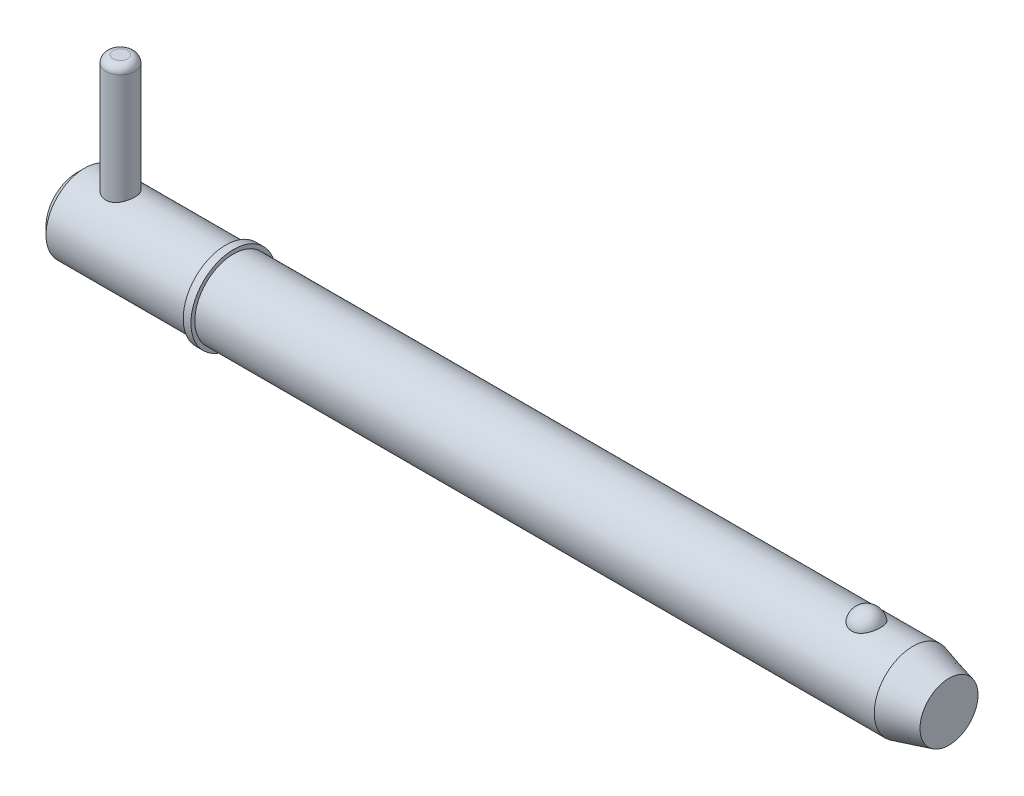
ISO-10303-21;
HEADER;
FILE_DESCRIPTION(('STEP AP214'),'2;1');
FILE_NAME('part.step','',(''),(''),'','','');
FILE_SCHEMA(('AUTOMOTIVE_DESIGN { 1 0 10303 214 1 1 1 1 }'));
ENDSEC;
DATA;
#1=APPLICATION_CONTEXT('core data for automotive mechanical design processes');
#2=APPLICATION_PROTOCOL_DEFINITION('international standard','automotive_design',2000,#1);
#3=PRODUCT_CONTEXT('',#1,'mechanical');
#4=PRODUCT('Part','Part','',(#3));
#5=PRODUCT_RELATED_PRODUCT_CATEGORY('part','',(#4));
#6=PRODUCT_DEFINITION_FORMATION('','',#4);
#7=PRODUCT_DEFINITION_CONTEXT('part definition',#1,'design');
#8=PRODUCT_DEFINITION('design','',#6,#7);
#9=PRODUCT_DEFINITION_SHAPE('','',#8);
#10=(LENGTH_UNIT() NAMED_UNIT(*) SI_UNIT(.MILLI.,.METRE.));
#11=(NAMED_UNIT(*) PLANE_ANGLE_UNIT() SI_UNIT($,.RADIAN.));
#12=(NAMED_UNIT(*) SI_UNIT($,.STERADIAN.) SOLID_ANGLE_UNIT());
#13=UNCERTAINTY_MEASURE_WITH_UNIT(LENGTH_MEASURE(1.E-05),#10,'distance_accuracy_value','');
#14=(GEOMETRIC_REPRESENTATION_CONTEXT(3) GLOBAL_UNCERTAINTY_ASSIGNED_CONTEXT((#13)) GLOBAL_UNIT_ASSIGNED_CONTEXT((#10,
#11,#12)) REPRESENTATION_CONTEXT('',''));
#15=CARTESIAN_POINT('',(0.,0.,0.));
#16=DIRECTION('',(0.,0.,1.));
#17=DIRECTION('',(1.,0.,0.));
#18=AXIS2_PLACEMENT_3D('',#15,#16,#17);
#19=CARTESIAN_POINT('',(7.14,25.4,0.));
#20=DIRECTION('',(0.,-1.,0.));
#21=DIRECTION('',(0.,0.,-1.));
#22=AXIS2_PLACEMENT_3D('',#19,#20,#21);
#23=CYLINDRICAL_SURFACE('',#22,2.38);
#24=CARTESIAN_POINT('',(7.14,-5.16,0.));
#25=DIRECTION('',(0.,1.,0.));
#26=DIRECTION('',(0.,0.,1.));
#27=AXIS2_PLACEMENT_3D('',#24,#25,#26);
#28=CIRCLE('',#27,2.38);
#29=CARTESIAN_POINT('',(7.14,-5.16,2.38));
#30=VERTEX_POINT('',#29);
#31=EDGE_CURVE('P0_E25',#30,#30,#28,.T.);
#32=ORIENTED_EDGE('',*,*,#31,.T.);
#33=EDGE_LOOP('',(#32));
#34=FACE_BOUND('',#33,.T.);
#35=CARTESIAN_POINT('',(7.14,24.21,0.));
#36=DIRECTION('',(0.,1.,0.));
#37=DIRECTION('',(0.,0.,1.));
#38=AXIS2_PLACEMENT_3D('',#35,#36,#37);
#39=CIRCLE('',#38,2.38);
#40=CARTESIAN_POINT('',(7.14,24.21,2.38));
#41=VERTEX_POINT('',#40);
#42=EDGE_CURVE('P0_E29',#41,#41,#39,.F.);
#43=ORIENTED_EDGE('',*,*,#42,.T.);
#44=EDGE_LOOP('',(#43));
#45=FACE_BOUND('',#44,.T.);
#46=ADVANCED_FACE('P0_F14',(#34,#45),#23,.T.);
#47=CARTESIAN_POINT('',(7.14,25.4,0.));
#48=DIRECTION('',(0.,1.,0.));
#49=DIRECTION('',(0.,0.,1.));
#50=AXIS2_PLACEMENT_3D('',#47,#48,#49);
#51=PLANE('',#50);
#52=CARTESIAN_POINT('',(7.14,25.4,0.));
#53=DIRECTION('',(0.,1.,0.));
#54=DIRECTION('',(0.,0.,1.));
#55=AXIS2_PLACEMENT_3D('',#52,#53,#54);
#56=CIRCLE('',#55,1.19);
#57=CARTESIAN_POINT('',(7.14,25.4,1.19));
#58=VERTEX_POINT('',#57);
#59=EDGE_CURVE('P0_E10',#58,#58,#56,.T.);
#60=ORIENTED_EDGE('',*,*,#59,.T.);
#61=EDGE_LOOP('',(#60));
#62=FACE_BOUND('',#61,.T.);
#63=ADVANCED_FACE('P0_F46',(#62),#51,.T.);
#64=CARTESIAN_POINT('',(7.14,-6.35,0.));
#65=DIRECTION('',(0.,1.,0.));
#66=DIRECTION('',(0.,0.,1.));
#67=AXIS2_PLACEMENT_3D('',#64,#65,#66);
#68=PLANE('',#67);
#69=CARTESIAN_POINT('',(7.14,-6.35,0.));
#70=DIRECTION('',(0.,1.,0.));
#71=DIRECTION('',(0.,0.,1.));
#72=AXIS2_PLACEMENT_3D('',#69,#70,#71);
#73=CIRCLE('',#72,1.19);
#74=CARTESIAN_POINT('',(7.14,-6.35,1.19));
#75=VERTEX_POINT('',#74);
#76=EDGE_CURVE('P0_E21',#75,#75,#73,.F.);
#77=ORIENTED_EDGE('',*,*,#76,.T.);
#78=EDGE_LOOP('',(#77));
#79=FACE_BOUND('',#78,.T.);
#80=ADVANCED_FACE('P0_F43',(#79),#68,.F.);
#81=CARTESIAN_POINT('',(7.14,-5.16,0.));
#82=DIRECTION('',(0.,1.,0.));
#83=DIRECTION('',(0.,0.,1.));
#84=AXIS2_PLACEMENT_3D('',#81,#82,#83);
#85=DEGENERATE_TOROIDAL_SURFACE('',#84,1.19,1.19,.T.);
#86=ORIENTED_EDGE('',*,*,#76,.F.);
#87=EDGE_LOOP('',(#86));
#88=FACE_BOUND('',#87,.T.);
#89=ORIENTED_EDGE('',*,*,#31,.F.);
#90=EDGE_LOOP('',(#89));
#91=FACE_BOUND('',#90,.T.);
#92=ADVANCED_FACE('P0_F38',(#88,#91),#85,.T.);
#93=CARTESIAN_POINT('',(7.14,24.21,0.));
#94=DIRECTION('',(0.,1.,0.));
#95=DIRECTION('',(0.,0.,1.));
#96=AXIS2_PLACEMENT_3D('',#93,#94,#95);
#97=DEGENERATE_TOROIDAL_SURFACE('',#96,1.19,1.19,.T.);
#98=ORIENTED_EDGE('',*,*,#42,.F.);
#99=EDGE_LOOP('',(#98));
#100=FACE_BOUND('',#99,.T.);
#101=ORIENTED_EDGE('',*,*,#59,.F.);
#102=EDGE_LOOP('',(#101));
#103=FACE_BOUND('',#102,.T.);
#104=ADVANCED_FACE('P0_F16',(#100,#103),#97,.T.);
#105=CLOSED_SHELL('',(#46,#63,#80,#92,#104));
#106=MANIFOLD_SOLID_BREP('P0_B1',#105);
#107=CARTESIAN_POINT('',(0.,0.,0.));
#108=DIRECTION('',(1.,0.,0.));
#109=DIRECTION('',(0.,0.,-1.));
#110=AXIS2_PLACEMENT_3D('',#107,#108,#109);
#111=CYLINDRICAL_SURFACE('',#110,6.35);
#112=CARTESIAN_POINT('',(137.255369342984,0.,0.));
#113=DIRECTION('',(1.,0.,0.));
#114=DIRECTION('',(0.,0.,-1.));
#115=AXIS2_PLACEMENT_3D('',#112,#113,#114);
#116=CIRCLE('',#115,6.35);
#117=CARTESIAN_POINT('',(137.255369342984,0.,-6.35));
#118=VERTEX_POINT('',#117);
#119=EDGE_CURVE('P1_E81',#118,#118,#116,.T.);
#120=ORIENTED_EDGE('',*,*,#119,.F.);
#121=EDGE_LOOP('',(#120));
#122=FACE_BOUND('',#121,.T.);
#123=CARTESIAN_POINT('',(25.7,0.,0.));
#124=DIRECTION('',(1.,0.,0.));
#125=DIRECTION('',(0.,0.,-1.));
#126=AXIS2_PLACEMENT_3D('',#123,#124,#125);
#127=CIRCLE('',#126,6.35);
#128=CARTESIAN_POINT('',(25.7,0.,-6.35));
#129=VERTEX_POINT('',#128);
#130=EDGE_CURVE('P1_E85',#129,#129,#127,.T.);
#131=ORIENTED_EDGE('',*,*,#130,.T.);
#132=EDGE_LOOP('',(#131));
#133=FACE_BOUND('',#132,.T.);
#134=CARTESIAN_POINT('',(129.630021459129,5.87502187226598,2.40969251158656));
#135=CARTESIAN_POINT('',(129.505030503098,5.87501645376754,2.40969773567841));
#136=CARTESIAN_POINT('',(129.380080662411,5.87916061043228,2.3996729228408));
#137=CARTESIAN_POINT('',(129.133909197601,5.89523112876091,2.35991730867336));
#138=CARTESIAN_POINT('',(129.012686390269,5.90715499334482,2.33019283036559));
#139=CARTESIAN_POINT('',(128.777517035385,5.9373956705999,2.25201402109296));
#140=CARTESIAN_POINT('',(128.663560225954,5.95570321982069,2.20358681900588));
#141=CARTESIAN_POINT('',(128.44557352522,5.99672067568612,2.08937987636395));
#142=CARTESIAN_POINT('',(128.341545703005,6.01943149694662,2.0235965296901));
#143=CARTESIAN_POINT('',(128.142943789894,6.06760647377,1.87428969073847));
#144=CARTESIAN_POINT('',(128.048726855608,6.0931309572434,1.79031110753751));
#145=CARTESIAN_POINT('',(127.875255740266,6.14375873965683,1.60800178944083));
#146=CARTESIAN_POINT('',(127.796004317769,6.16886196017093,1.50966841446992));
#147=CARTESIAN_POINT('',(127.650845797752,6.2172460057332,1.29645884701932));
#148=CARTESIAN_POINT('',(127.585688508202,6.24039621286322,1.18104158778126));
#149=CARTESIAN_POINT('',(127.474703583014,6.28117277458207,0.940351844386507));
#150=CARTESIAN_POINT('',(127.428877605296,6.29879865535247,0.815078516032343));
#151=CARTESIAN_POINT('',(127.357023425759,6.32692073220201,0.556494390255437));
#152=CARTESIAN_POINT('',(127.331249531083,6.33732517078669,0.423102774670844));
#153=CARTESIAN_POINT('',(127.300988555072,6.34957673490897,0.15354272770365));
#154=CARTESIAN_POINT('',(127.296500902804,6.35142408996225,0.0173743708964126));
#155=CARTESIAN_POINT('',(127.308865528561,6.34638925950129,-0.253036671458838));
#156=CARTESIAN_POINT('',(127.325594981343,6.33955731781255,-0.38728593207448));
#157=CARTESIAN_POINT('',(127.379843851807,6.31794129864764,-0.650851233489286));
#158=CARTESIAN_POINT('',(127.417363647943,6.30315707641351,-0.780167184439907));
#159=CARTESIAN_POINT('',(127.512500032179,6.26711642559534,-1.03041949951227));
#160=CARTESIAN_POINT('',(127.570143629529,6.24585130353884,-1.1513443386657));
#161=CARTESIAN_POINT('',(127.704352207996,6.19905619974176,-1.38129800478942));
#162=CARTESIAN_POINT('',(127.780918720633,6.17352587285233,-1.49032586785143));
#163=CARTESIAN_POINT('',(127.951753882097,6.12080227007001,-1.69393164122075));
#164=CARTESIAN_POINT('',(128.046100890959,6.09360200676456,-1.78844209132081));
#165=CARTESIAN_POINT('',(128.250119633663,6.0407043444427,-1.95970536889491));
#166=CARTESIAN_POINT('',(128.359790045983,6.01500681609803,-2.03645972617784));
#167=CARTESIAN_POINT('',(128.589187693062,5.96867714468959,-2.16845644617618));
#168=CARTESIAN_POINT('',(128.708652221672,5.94794910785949,-2.22412062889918));
#169=CARTESIAN_POINT('',(128.956218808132,5.91340580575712,-2.31440992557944));
#170=CARTESIAN_POINT('',(129.084317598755,5.8995879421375,-2.34904294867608));
#171=CARTESIAN_POINT('',(129.338582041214,5.88111049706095,-2.39491590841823));
#172=CARTESIAN_POINT('',(129.464520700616,5.876025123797,-2.40724512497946));
#173=CARTESIAN_POINT('',(129.716786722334,5.87428980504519,-2.41147867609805));
#174=CARTESIAN_POINT('',(129.843114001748,5.87763817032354,-2.4033871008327));
#175=CARTESIAN_POINT('',(130.088417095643,5.89212921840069,-2.36762715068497));
#176=CARTESIAN_POINT('',(130.207499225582,5.90302431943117,-2.34058030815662));
#177=CARTESIAN_POINT('',(130.43924472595,5.93113752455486,-2.26839066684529));
#178=CARTESIAN_POINT('',(130.551907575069,5.94835614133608,-2.22324640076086));
#179=CARTESIAN_POINT('',(130.770400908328,5.98773016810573,-2.1149380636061));
#180=CARTESIAN_POINT('',(130.876028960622,6.00998499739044,-2.05140269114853));
#181=CARTESIAN_POINT('',(131.075300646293,6.0569014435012,-1.9084270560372));
#182=CARTESIAN_POINT('',(131.168941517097,6.08156361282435,-1.82898313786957));
#183=CARTESIAN_POINT('',(131.346675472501,6.13211715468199,-1.65182429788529));
#184=CARTESIAN_POINT('',(131.430055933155,6.15800825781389,-1.55339381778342));
#185=CARTESIAN_POINT('',(131.579790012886,6.2071283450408,-1.34374214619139));
#186=CARTESIAN_POINT('',(131.646140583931,6.23035685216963,-1.23251867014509));
#187=CARTESIAN_POINT('',(131.762345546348,6.27251177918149,-0.99644720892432));
#188=CARTESIAN_POINT('',(131.811607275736,6.29127762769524,-0.871278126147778));
#189=CARTESIAN_POINT('',(131.889614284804,6.3215862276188,-0.613870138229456));
#190=CARTESIAN_POINT('',(131.918359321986,6.33312889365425,-0.481631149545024));
#191=CARTESIAN_POINT('',(131.95477058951,6.34782349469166,-0.213672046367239));
#192=CARTESIAN_POINT('',(131.962413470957,6.35096613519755,-0.0779482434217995));
#193=CARTESIAN_POINT('',(131.956395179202,6.34851322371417,0.192943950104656));
#194=CARTESIAN_POINT('',(131.942734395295,6.3429178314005,0.328112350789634));
#195=CARTESIAN_POINT('',(131.89450361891,6.32360512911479,0.593406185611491));
#196=CARTESIAN_POINT('',(131.860031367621,6.30992579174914,0.723552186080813));
#197=CARTESIAN_POINT('',(131.770953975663,6.27586325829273,0.975834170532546));
#198=CARTESIAN_POINT('',(131.71634761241,6.25547965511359,1.09796966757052));
#199=CARTESIAN_POINT('',(131.58775879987,6.20998183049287,1.33148921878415));
#200=CARTESIAN_POINT('',(131.513674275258,6.18484288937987,1.44281227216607));
#201=CARTESIAN_POINT('',(131.347820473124,6.13258735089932,1.65087683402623));
#202=CARTESIAN_POINT('',(131.256051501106,6.10547078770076,1.74761859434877));
#203=CARTESIAN_POINT('',(131.057183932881,6.05235879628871,1.92350926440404));
#204=CARTESIAN_POINT('',(130.950133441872,6.02636017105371,2.00271146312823));
#205=CARTESIAN_POINT('',(130.723138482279,5.97843747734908,2.14154159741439));
#206=CARTESIAN_POINT('',(130.603191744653,5.95651412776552,2.2011660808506));
#207=CARTESIAN_POINT('',(130.344523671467,5.91812106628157,2.30250570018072));
#208=CARTESIAN_POINT('',(130.20506980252,5.90217533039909,2.34256795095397));
#209=CARTESIAN_POINT('',(129.920397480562,5.88063128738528,2.39615214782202));
#210=CARTESIAN_POINT('',(129.77518174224,5.87502816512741,2.40968644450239));
#211=CARTESIAN_POINT('',(129.630021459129,5.87502187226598,2.40969251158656));
#212=B_SPLINE_CURVE_WITH_KNOTS('',3,(#134,#135,#136,#137,#138,#139,#140,#141,#142,#143,#144,
#145,#146,#147,#148,#149,#150,#151,#152,#153,#154,#155,#156,#157,#158,#159,#160,#161,#162,#163,
#164,#165,#166,#167,#168,#169,#170,#171,#172,#173,#174,#175,#176,#177,#178,#179,#180,#181,#182,
#183,#184,#185,#186,#187,#188,#189,#190,#191,#192,#193,#194,#195,#196,#197,#198,#199,#200,#201,
#202,#203,#204,#205,#206,#207,#208,#209,#210,#211),.UNSPECIFIED.,.T.,.F.,(4,2,2,2,2,2,2,2,2,2,2,
2,2,2,2,2,2,2,2,2,2,2,2,2,2,2,2,2,2,2,2,2,2,2,2,2,2,2,4),(0.,0.374440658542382,
0.748761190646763,1.12254078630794,1.49639810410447,1.88098871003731,2.2656501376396,
2.66741104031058,3.06920639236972,3.47601794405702,3.88281858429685,4.28727498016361,
4.69173873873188,5.09674745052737,5.50178895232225,5.90865911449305,6.31549420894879,
6.71369855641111,7.11175305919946,7.48978077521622,7.8677327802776,8.23383886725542,
8.5999746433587,8.97409044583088,9.34829231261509,9.74122667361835,10.1342313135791,
10.539752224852,10.945277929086,11.3512521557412,11.7572189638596,12.1612938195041,
12.5653932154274,12.9716540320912,13.37790783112,13.782909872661,14.1879832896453,
14.6230486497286,15.0579114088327),.UNSPECIFIED.);
#213=CARTESIAN_POINT('',(129.630021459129,5.87502187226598,2.40969251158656));
#214=VERTEX_POINT('',#213);
#215=EDGE_CURVE('P1_E35',#214,#214,#212,.T.);
#216=ORIENTED_EDGE('',*,*,#215,.T.);
#217=EDGE_LOOP('',(#216));
#218=FACE_BOUND('',#217,.T.);
#219=ADVANCED_FACE('P1_F13',(#122,#133,#218),#111,.T.);
#220=CARTESIAN_POINT('',(0.,0.,0.));
#221=DIRECTION('',(-1.,0.,0.));
#222=DIRECTION('',(0.,0.,1.));
#223=AXIS2_PLACEMENT_3D('',#220,#221,#222);
#224=PLANE('',#223);
#225=CARTESIAN_POINT('',(0.,0.,0.));
#226=DIRECTION('',(1.,0.,0.));
#227=DIRECTION('',(0.,0.,-1.));
#228=AXIS2_PLACEMENT_3D('',#225,#226,#227);
#229=CIRCLE('',#228,5.08);
#230=CARTESIAN_POINT('',(0.,0.,-5.08));
#231=VERTEX_POINT('',#230);
#232=EDGE_CURVE('P1_E9',#231,#231,#229,.T.);
#233=ORIENTED_EDGE('',*,*,#232,.F.);
#234=EDGE_LOOP('',(#233));
#235=FACE_BOUND('',#234,.T.);
#236=ADVANCED_FACE('P1_F15',(#235),#224,.T.);
#237=CARTESIAN_POINT('',(1.27,0.,0.));
#238=DIRECTION('',(1.,0.,0.));
#239=DIRECTION('',(0.,0.,-1.));
#240=AXIS2_PLACEMENT_3D('',#237,#238,#239);
#241=CONICAL_SURFACE('',#240,6.35,0.78539816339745);
#242=ORIENTED_EDGE('',*,*,#232,.T.);
#243=EDGE_LOOP('',(#242));
#244=FACE_BOUND('',#243,.T.);
#245=CARTESIAN_POINT('',(1.27,0.,0.));
#246=DIRECTION('',(1.,0.,0.));
#247=DIRECTION('',(0.,0.,-1.));
#248=AXIS2_PLACEMENT_3D('',#245,#246,#247);
#249=CIRCLE('',#248,6.35);
#250=CARTESIAN_POINT('',(1.27,0.,-6.35));
#251=VERTEX_POINT('',#250);
#252=EDGE_CURVE('P1_E26',#251,#251,#249,.T.);
#253=ORIENTED_EDGE('',*,*,#252,.F.);
#254=EDGE_LOOP('',(#253));
#255=FACE_BOUND('',#254,.T.);
#256=ADVANCED_FACE('P1_F77',(#244,#255),#241,.T.);
#257=CARTESIAN_POINT('',(0.,0.,0.));
#258=DIRECTION('',(1.,0.,0.));
#259=DIRECTION('',(0.,0.,-1.));
#260=AXIS2_PLACEMENT_3D('',#257,#258,#259);
#261=CYLINDRICAL_SURFACE('',#260,6.35);
#262=CARTESIAN_POINT('',(7.14,-5.88711304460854,2.38));
#263=CARTESIAN_POINT('',(7.01146258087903,-5.88710856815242,2.38000480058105));
#264=CARTESIAN_POINT('',(6.88295682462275,-5.89136840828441,2.36955244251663));
#265=CARTESIAN_POINT('',(6.62981934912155,-5.90782785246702,2.32820953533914));
#266=CARTESIAN_POINT('',(6.50518751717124,-5.92002722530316,2.29731958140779));
#267=CARTESIAN_POINT('',(6.26352403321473,-5.95079384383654,2.21639366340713));
#268=CARTESIAN_POINT('',(6.14647496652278,-5.96934583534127,2.16640353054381));
#269=CARTESIAN_POINT('',(5.92237941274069,-6.01070278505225,2.04885862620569));
#270=CARTESIAN_POINT('',(5.81533593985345,-6.03350901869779,1.98129858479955));
#271=CARTESIAN_POINT('',(5.60897525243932,-6.08207341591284,1.82693902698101));
#272=CARTESIAN_POINT('',(5.51022503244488,-6.10791836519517,1.73940861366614));
#273=CARTESIAN_POINT('',(5.32840561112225,-6.15892405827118,1.54914379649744));
#274=CARTESIAN_POINT('',(5.24533975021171,-6.1840846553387,1.44640616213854));
#275=CARTESIAN_POINT('',(5.09451639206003,-6.23191821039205,1.22434014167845));
#276=CARTESIAN_POINT('',(5.02737511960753,-6.25447755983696,1.10456656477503));
#277=CARTESIAN_POINT('',(4.91443001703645,-6.2935236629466,0.854429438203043));
#278=CARTESIAN_POINT('',(4.86861879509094,-6.31001251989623,0.724069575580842));
#279=CARTESIAN_POINT('',(4.80162253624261,-6.33444370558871,0.46242122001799));
#280=CARTESIAN_POINT('',(4.77946137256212,-6.34272370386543,0.331414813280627));
#281=CARTESIAN_POINT('',(4.75726677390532,-6.35101600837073,0.0672982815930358));
#282=CARTESIAN_POINT('',(4.75722615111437,-6.35103100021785,-0.0658111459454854));
#283=CARTESIAN_POINT('',(4.77870510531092,-6.3430064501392,-0.323358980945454));
#284=CARTESIAN_POINT('',(4.79915922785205,-6.33536494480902,-0.447900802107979));
#285=CARTESIAN_POINT('',(4.85925493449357,-6.31340794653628,-0.69163609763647));
#286=CARTESIAN_POINT('',(4.89889787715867,-6.29909198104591,-0.810829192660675));
#287=CARTESIAN_POINT('',(4.9967414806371,-6.26494471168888,-1.04254212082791));
#288=CARTESIAN_POINT('',(5.05520370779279,-6.24503620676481,-1.1549396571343));
#289=CARTESIAN_POINT('',(5.1887948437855,-6.20171869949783,-1.3686079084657));
#290=CARTESIAN_POINT('',(5.26392912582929,-6.17830856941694,-1.46987502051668));
#291=CARTESIAN_POINT('',(5.43386591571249,-6.12878580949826,-1.66468415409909));
#292=CARTESIAN_POINT('',(5.52956139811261,-6.10259519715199,-1.75742857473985));
#293=CARTESIAN_POINT('',(5.73530435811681,-6.05155777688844,-1.92585331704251));
#294=CARTESIAN_POINT('',(5.84535542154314,-6.02671130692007,-2.00152936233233));
#295=CARTESIAN_POINT('',(6.07982989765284,-5.98068420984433,-2.13519109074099));
#296=CARTESIAN_POINT('',(6.20451768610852,-5.95959698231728,-2.19274775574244));
#297=CARTESIAN_POINT('',(6.4628145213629,-5.92455622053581,-2.28574558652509));
#298=CARTESIAN_POINT('',(6.59641856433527,-5.91059872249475,-2.32119904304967));
#299=CARTESIAN_POINT('',(6.86087441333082,-5.8923327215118,-2.36717069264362));
#300=CARTESIAN_POINT('',(6.99147192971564,-5.8875347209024,-2.37895573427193));
#301=CARTESIAN_POINT('',(7.25283805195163,-5.88674545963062,-2.38091046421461));
#302=CARTESIAN_POINT('',(7.38360660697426,-5.89075200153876,-2.37108554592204));
#303=CARTESIAN_POINT('',(7.63510696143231,-5.90662331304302,-2.33124781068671));
#304=CARTESIAN_POINT('',(7.75602069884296,-5.91810660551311,-2.30221396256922));
#305=CARTESIAN_POINT('',(7.99120505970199,-5.94718527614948,-2.22601401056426));
#306=CARTESIAN_POINT('',(8.10547431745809,-5.96478190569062,-2.17884419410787));
#307=CARTESIAN_POINT('',(8.32888632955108,-6.00491533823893,-2.06572311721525));
#308=CARTESIAN_POINT('',(8.43767672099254,-6.02761250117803,-1.99913452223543));
#309=CARTESIAN_POINT('',(8.6429894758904,-6.07511988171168,-1.84974438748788));
#310=CARTESIAN_POINT('',(8.73950733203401,-6.09993087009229,-1.76693691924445));
#311=CARTESIAN_POINT('',(8.9238741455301,-6.1507686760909,-1.58125563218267));
#312=CARTESIAN_POINT('',(9.01078732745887,-6.17677301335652,-1.47744327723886));
#313=CARTESIAN_POINT('',(9.16607127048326,-6.22556172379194,-1.25606967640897));
#314=CARTESIAN_POINT('',(9.23444197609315,-6.24834608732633,-1.13850838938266));
#315=CARTESIAN_POINT('',(9.3502493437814,-6.28811144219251,-0.893050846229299));
#316=CARTESIAN_POINT('',(9.39775808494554,-6.30511236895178,-0.765192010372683));
#317=CARTESIAN_POINT('',(9.47032640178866,-6.33145833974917,-0.502514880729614));
#318=CARTESIAN_POINT('',(9.49539651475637,-6.34080697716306,-0.367699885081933));
#319=CARTESIAN_POINT('',(9.52124059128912,-6.35045496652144,-0.103396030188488));
#320=CARTESIAN_POINT('',(9.52334421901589,-6.35124952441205,0.025945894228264));
#321=CARTESIAN_POINT('',(9.50661518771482,-6.34499064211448,0.283061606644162));
#322=CARTESIAN_POINT('',(9.48778504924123,-6.33793814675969,0.410835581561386));
#323=CARTESIAN_POINT('',(9.43065630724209,-6.31700307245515,0.658028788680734));
#324=CARTESIAN_POINT('',(9.39284291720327,-6.30329098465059,0.7775756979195));
#325=CARTESIAN_POINT('',(9.29930406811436,-6.27046903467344,1.00863789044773));
#326=CARTESIAN_POINT('',(9.2435752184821,-6.25135815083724,1.12015164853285));
#327=CARTESIAN_POINT('',(9.11312349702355,-6.20865254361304,1.33711407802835));
#328=CARTESIAN_POINT('',(9.03770094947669,-6.18490316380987,1.44211105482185));
#329=CARTESIAN_POINT('',(8.87110640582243,-6.13583718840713,1.63836897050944));
#330=CARTESIAN_POINT('',(8.77992879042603,-6.11052003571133,1.72962498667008));
#331=CARTESIAN_POINT('',(8.57869799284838,-6.05953829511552,1.90076098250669));
#332=CARTESIAN_POINT('',(8.46790320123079,-6.03392573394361,1.97978778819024));
#333=CARTESIAN_POINT('',(8.23379693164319,-5.98676607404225,2.11813466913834));
#334=CARTESIAN_POINT('',(8.11048418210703,-5.9652193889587,2.17745273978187));
#335=CARTESIAN_POINT('',(7.84900037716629,-5.92818393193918,2.27641807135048));
#336=CARTESIAN_POINT('',(7.71041678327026,-5.91299857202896,2.31510015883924));
#337=CARTESIAN_POINT('',(7.42787316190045,-5.89246887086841,2.36688002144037));
#338=CARTESIAN_POINT('',(7.28391673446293,-5.88711805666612,2.37999462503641));
#339=CARTESIAN_POINT('',(7.14,-5.88711304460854,2.38));
#340=B_SPLINE_CURVE_WITH_KNOTS('',3,(#262,#263,#264,#265,#266,#267,#268,#269,#270,#271,#272,
#273,#274,#275,#276,#277,#278,#279,#280,#281,#282,#283,#284,#285,#286,#287,#288,#289,#290,#291,
#292,#293,#294,#295,#296,#297,#298,#299,#300,#301,#302,#303,#304,#305,#306,#307,#308,#309,#310,
#311,#312,#313,#314,#315,#316,#317,#318,#319,#320,#321,#322,#323,#324,#325,#326,#327,#328,#329,
#330,#331,#332,#333,#334,#335,#336,#337,#338,#339),.UNSPECIFIED.,.T.,.F.,(4,2,2,2,2,2,2,2,2,2,2,
2,2,2,2,2,2,2,2,2,2,2,2,2,2,2,2,2,2,2,2,2,2,2,2,2,2,2,4),(0.,0.385076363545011,
0.770141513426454,1.15428843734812,1.53855071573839,1.94016118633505,2.3418570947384,
2.75720522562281,3.1724093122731,3.569721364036,3.96690431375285,4.34445758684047,
4.72203759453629,5.10511017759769,5.48830640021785,5.89390240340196,6.29959991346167,
6.71428455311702,7.12873839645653,7.52034494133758,7.91185376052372,8.28480528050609,
8.65783318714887,9.0448340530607,9.43197664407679,9.84363087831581,10.2552863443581,
10.6655081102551,11.0755371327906,11.4616919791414,11.847800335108,12.224507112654,
12.6012852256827,12.9938941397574,13.386643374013,13.8000944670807,14.2135876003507,
14.6450218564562,15.0761720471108),.UNSPECIFIED.);
#341=CARTESIAN_POINT('',(7.14,-5.88711304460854,2.38));
#342=VERTEX_POINT('',#341);
#343=EDGE_CURVE('P1_E17',#342,#342,#340,.T.);
#344=ORIENTED_EDGE('',*,*,#343,.F.);
#345=EDGE_LOOP('',(#344));
#346=FACE_BOUND('',#345,.T.);
#347=CARTESIAN_POINT('',(7.14,5.88711304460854,2.38));
#348=CARTESIAN_POINT('',(7.26853741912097,5.88710856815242,2.38000480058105));
#349=CARTESIAN_POINT('',(7.39704317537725,5.89136840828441,2.36955244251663));
#350=CARTESIAN_POINT('',(7.65018065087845,5.90782785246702,2.32820953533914));
#351=CARTESIAN_POINT('',(7.77481248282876,5.92002722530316,2.29731958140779));
#352=CARTESIAN_POINT('',(8.01647596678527,5.95079384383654,2.21639366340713));
#353=CARTESIAN_POINT('',(8.13352503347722,5.96934583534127,2.16640353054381));
#354=CARTESIAN_POINT('',(8.35762058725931,6.01070278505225,2.04885862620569));
#355=CARTESIAN_POINT('',(8.46466406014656,6.03350901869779,1.98129858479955));
#356=CARTESIAN_POINT('',(8.67102474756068,6.08207341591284,1.82693902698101));
#357=CARTESIAN_POINT('',(8.76977496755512,6.10791836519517,1.73940861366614));
#358=CARTESIAN_POINT('',(8.95159438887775,6.15892405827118,1.54914379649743));
#359=CARTESIAN_POINT('',(9.03466024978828,6.1840846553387,1.44640616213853));
#360=CARTESIAN_POINT('',(9.18548360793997,6.23191821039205,1.22434014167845));
#361=CARTESIAN_POINT('',(9.25262488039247,6.25447755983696,1.10456656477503));
#362=CARTESIAN_POINT('',(9.36556998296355,6.2935236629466,0.854429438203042));
#363=CARTESIAN_POINT('',(9.41138120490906,6.31001251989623,0.72406957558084));
#364=CARTESIAN_POINT('',(9.47837746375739,6.33444370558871,0.462421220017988));
#365=CARTESIAN_POINT('',(9.50053862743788,6.34272370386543,0.331414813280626));
#366=CARTESIAN_POINT('',(9.52273322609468,6.35101600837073,0.0672982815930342));
#367=CARTESIAN_POINT('',(9.52277384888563,6.35103100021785,-0.0658111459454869));
#368=CARTESIAN_POINT('',(9.50129489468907,6.3430064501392,-0.323358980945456));
#369=CARTESIAN_POINT('',(9.48084077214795,6.33536494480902,-0.447900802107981));
#370=CARTESIAN_POINT('',(9.42074506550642,6.31340794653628,-0.691636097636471));
#371=CARTESIAN_POINT('',(9.38110212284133,6.29909198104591,-0.810829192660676));
#372=CARTESIAN_POINT('',(9.2832585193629,6.26494471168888,-1.04254212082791));
#373=CARTESIAN_POINT('',(9.22479629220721,6.24503620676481,-1.1549396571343));
#374=CARTESIAN_POINT('',(9.0912051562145,6.20171869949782,-1.3686079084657));
#375=CARTESIAN_POINT('',(9.0160708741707,6.17830856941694,-1.46987502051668));
#376=CARTESIAN_POINT('',(8.84613408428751,6.12878580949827,-1.66468415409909));
#377=CARTESIAN_POINT('',(8.75043860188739,6.10259519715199,-1.75742857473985));
#378=CARTESIAN_POINT('',(8.54469564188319,6.05155777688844,-1.92585331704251));
#379=CARTESIAN_POINT('',(8.43464457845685,6.02671130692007,-2.00152936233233));
#380=CARTESIAN_POINT('',(8.20017010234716,5.98068420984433,-2.13519109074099));
#381=CARTESIAN_POINT('',(8.07548231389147,5.95959698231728,-2.19274775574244));
#382=CARTESIAN_POINT('',(7.8171854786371,5.9245562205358,-2.28574558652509));
#383=CARTESIAN_POINT('',(7.68358143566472,5.91059872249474,-2.32119904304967));
#384=CARTESIAN_POINT('',(7.41912558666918,5.8923327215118,-2.36717069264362));
#385=CARTESIAN_POINT('',(7.28852807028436,5.8875347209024,-2.37895573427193));
#386=CARTESIAN_POINT('',(7.02716194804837,5.88674545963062,-2.38091046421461));
#387=CARTESIAN_POINT('',(6.89639339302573,5.89075200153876,-2.37108554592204));
#388=CARTESIAN_POINT('',(6.64489303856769,5.90662331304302,-2.33124781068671));
#389=CARTESIAN_POINT('',(6.52397930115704,5.91810660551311,-2.30221396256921));
#390=CARTESIAN_POINT('',(6.288794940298,5.94718527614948,-2.22601401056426));
#391=CARTESIAN_POINT('',(6.17452568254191,5.96478190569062,-2.17884419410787));
#392=CARTESIAN_POINT('',(5.95111367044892,6.00491533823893,-2.06572311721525));
#393=CARTESIAN_POINT('',(5.84232327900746,6.02761250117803,-1.99913452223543));
#394=CARTESIAN_POINT('',(5.6370105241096,6.07511988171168,-1.84974438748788));
#395=CARTESIAN_POINT('',(5.54049266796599,6.09993087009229,-1.76693691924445));
#396=CARTESIAN_POINT('',(5.3561258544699,6.1507686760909,-1.58125563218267));
#397=CARTESIAN_POINT('',(5.26921267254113,6.17677301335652,-1.47744327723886));
#398=CARTESIAN_POINT('',(5.11392872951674,6.22556172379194,-1.25606967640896));
#399=CARTESIAN_POINT('',(5.04555802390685,6.24834608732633,-1.13850838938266));
#400=CARTESIAN_POINT('',(4.9297506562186,6.28811144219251,-0.893050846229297));
#401=CARTESIAN_POINT('',(4.88224191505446,6.30511236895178,-0.76519201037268));
#402=CARTESIAN_POINT('',(4.80967359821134,6.33145833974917,-0.502514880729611));
#403=CARTESIAN_POINT('',(4.78460348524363,6.34080697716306,-0.36769988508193));
#404=CARTESIAN_POINT('',(4.75875940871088,6.35045496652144,-0.103396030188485));
#405=CARTESIAN_POINT('',(4.75665578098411,6.35124952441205,0.025945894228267));
#406=CARTESIAN_POINT('',(4.77338481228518,6.34499064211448,0.283061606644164));
#407=CARTESIAN_POINT('',(4.79221495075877,6.33793814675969,0.410835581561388));
#408=CARTESIAN_POINT('',(4.84934369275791,6.31700307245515,0.658028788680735));
#409=CARTESIAN_POINT('',(4.88715708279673,6.30329098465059,0.777575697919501));
#410=CARTESIAN_POINT('',(4.98069593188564,6.27046903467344,1.00863789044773));
#411=CARTESIAN_POINT('',(5.0364247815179,6.25135815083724,1.12015164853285));
#412=CARTESIAN_POINT('',(5.16687650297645,6.20865254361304,1.33711407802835));
#413=CARTESIAN_POINT('',(5.24229905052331,6.18490316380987,1.44211105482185));
#414=CARTESIAN_POINT('',(5.40889359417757,6.13583718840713,1.63836897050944));
#415=CARTESIAN_POINT('',(5.50007120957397,6.11052003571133,1.72962498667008));
#416=CARTESIAN_POINT('',(5.70130200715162,6.05953829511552,1.90076098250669));
#417=CARTESIAN_POINT('',(5.81209679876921,6.03392573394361,1.97978778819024));
#418=CARTESIAN_POINT('',(6.04620306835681,5.98676607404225,2.11813466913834));
#419=CARTESIAN_POINT('',(6.16951581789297,5.9652193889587,2.17745273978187));
#420=CARTESIAN_POINT('',(6.43099962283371,5.92818393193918,2.27641807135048));
#421=CARTESIAN_POINT('',(6.56958321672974,5.91299857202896,2.31510015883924));
#422=CARTESIAN_POINT('',(6.85212683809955,5.89246887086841,2.36688002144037));
#423=CARTESIAN_POINT('',(6.99608326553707,5.88711805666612,2.37999462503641));
#424=CARTESIAN_POINT('',(7.14,5.88711304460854,2.38));
#425=B_SPLINE_CURVE_WITH_KNOTS('',3,(#347,#348,#349,#350,#351,#352,#353,#354,#355,#356,#357,
#358,#359,#360,#361,#362,#363,#364,#365,#366,#367,#368,#369,#370,#371,#372,#373,#374,#375,#376,
#377,#378,#379,#380,#381,#382,#383,#384,#385,#386,#387,#388,#389,#390,#391,#392,#393,#394,#395,
#396,#397,#398,#399,#400,#401,#402,#403,#404,#405,#406,#407,#408,#409,#410,#411,#412,#413,#414,
#415,#416,#417,#418,#419,#420,#421,#422,#423,#424),.UNSPECIFIED.,.T.,.F.,(4,2,2,2,2,2,2,2,2,2,2,
2,2,2,2,2,2,2,2,2,2,2,2,2,2,2,2,2,2,2,2,2,2,2,2,2,2,2,4),(0.,0.385076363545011,
0.770141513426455,1.15428843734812,1.53855071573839,1.94016118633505,2.3418570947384,
2.75720522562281,3.1724093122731,3.56972136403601,3.96690431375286,4.34445758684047,
4.72203759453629,5.10511017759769,5.48830640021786,5.89390240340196,6.29959991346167,
6.71428455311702,7.12873839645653,7.52034494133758,7.91185376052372,8.2848052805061,
8.65783318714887,9.0448340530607,9.43197664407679,9.84363087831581,10.2552863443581,
10.6655081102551,11.0755371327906,11.4616919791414,11.847800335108,12.2245071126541,
12.6012852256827,12.9938941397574,13.386643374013,13.8000944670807,14.2135876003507,
14.6450218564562,15.0761720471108),.UNSPECIFIED.);
#426=CARTESIAN_POINT('',(7.14,5.88711304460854,2.38));
#427=VERTEX_POINT('',#426);
#428=EDGE_CURVE('P1_E43',#427,#427,#425,.T.);
#429=ORIENTED_EDGE('',*,*,#428,.F.);
#430=EDGE_LOOP('',(#429));
#431=FACE_BOUND('',#430,.T.);
#432=ORIENTED_EDGE('',*,*,#252,.T.);
#433=EDGE_LOOP('',(#432));
#434=FACE_BOUND('',#433,.T.);
#435=CARTESIAN_POINT('',(24.43,0.,0.));
#436=DIRECTION('',(1.,0.,0.));
#437=DIRECTION('',(0.,0.,-1.));
#438=AXIS2_PLACEMENT_3D('',#435,#436,#437);
#439=CIRCLE('',#438,6.35);
#440=CARTESIAN_POINT('',(24.43,0.,-6.35));
#441=VERTEX_POINT('',#440);
#442=EDGE_CURVE('P1_E31',#441,#441,#439,.T.);
#443=ORIENTED_EDGE('',*,*,#442,.F.);
#444=EDGE_LOOP('',(#443));
#445=FACE_BOUND('',#444,.T.);
#446=ADVANCED_FACE('P1_F103',(#346,#431,#434,#445),#261,.T.);
#447=CARTESIAN_POINT('',(24.43,6.35,0.));
#448=DIRECTION('',(-1.,0.,0.));
#449=DIRECTION('',(0.,0.,1.));
#450=AXIS2_PLACEMENT_3D('',#447,#448,#449);
#451=PLANE('',#450);
#452=ORIENTED_EDGE('',*,*,#442,.T.);
#453=EDGE_LOOP('',(#452));
#454=FACE_BOUND('',#453,.T.);
#455=CARTESIAN_POINT('',(24.43,0.,0.));
#456=DIRECTION('',(1.,0.,0.));
#457=DIRECTION('',(0.,0.,-1.));
#458=AXIS2_PLACEMENT_3D('',#455,#456,#457);
#459=CIRCLE('',#458,6.985);
#460=CARTESIAN_POINT('',(24.43,0.,-6.985));
#461=VERTEX_POINT('',#460);
#462=EDGE_CURVE('P1_E91',#461,#461,#459,.T.);
#463=ORIENTED_EDGE('',*,*,#462,.F.);
#464=EDGE_LOOP('',(#463));
#465=FACE_BOUND('',#464,.T.);
#466=ADVANCED_FACE('P1_F100',(#454,#465),#451,.T.);
#467=CARTESIAN_POINT('',(0.,0.,0.));
#468=DIRECTION('',(1.,0.,0.));
#469=DIRECTION('',(0.,0.,-1.));
#470=AXIS2_PLACEMENT_3D('',#467,#468,#469);
#471=CYLINDRICAL_SURFACE('',#470,6.985);
#472=ORIENTED_EDGE('',*,*,#462,.T.);
#473=EDGE_LOOP('',(#472));
#474=FACE_BOUND('',#473,.T.);
#475=CARTESIAN_POINT('',(25.7,0.,0.));
#476=DIRECTION('',(1.,0.,0.));
#477=DIRECTION('',(0.,0.,-1.));
#478=AXIS2_PLACEMENT_3D('',#475,#476,#477);
#479=CIRCLE('',#478,6.985);
#480=CARTESIAN_POINT('',(25.7,0.,-6.985));
#481=VERTEX_POINT('',#480);
#482=EDGE_CURVE('P1_E88',#481,#481,#479,.T.);
#483=ORIENTED_EDGE('',*,*,#482,.F.);
#484=EDGE_LOOP('',(#483));
#485=FACE_BOUND('',#484,.T.);
#486=ADVANCED_FACE('P1_F68',(#474,#485),#471,.T.);
#487=CARTESIAN_POINT('',(25.7,6.985,0.));
#488=DIRECTION('',(1.,0.,0.));
#489=DIRECTION('',(0.,0.,-1.));
#490=AXIS2_PLACEMENT_3D('',#487,#488,#489);
#491=PLANE('',#490);
#492=ORIENTED_EDGE('',*,*,#482,.T.);
#493=EDGE_LOOP('',(#492));
#494=FACE_BOUND('',#493,.T.);
#495=ORIENTED_EDGE('',*,*,#130,.F.);
#496=EDGE_LOOP('',(#495));
#497=FACE_BOUND('',#496,.T.);
#498=ADVANCED_FACE('P1_F62',(#494,#497),#491,.T.);
#499=CARTESIAN_POINT('',(143.18,0.,0.));
#500=DIRECTION('',(-1.,0.,0.));
#501=DIRECTION('',(0.,0.,1.));
#502=AXIS2_PLACEMENT_3D('',#499,#500,#501);
#503=CONICAL_SURFACE('',#502,4.76250000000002,0.261799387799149);
#504=ORIENTED_EDGE('',*,*,#119,.T.);
#505=EDGE_LOOP('',(#504));
#506=FACE_BOUND('',#505,.T.);
#507=CARTESIAN_POINT('',(143.18,0.,0.));
#508=DIRECTION('',(1.,0.,0.));
#509=DIRECTION('',(0.,0.,-1.));
#510=AXIS2_PLACEMENT_3D('',#507,#508,#509);
#511=CIRCLE('',#510,4.76250000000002);
#512=CARTESIAN_POINT('',(143.18,0.,-4.76250000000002));
#513=VERTEX_POINT('',#512);
#514=EDGE_CURVE('P1_E42',#513,#513,#511,.T.);
#515=ORIENTED_EDGE('',*,*,#514,.F.);
#516=EDGE_LOOP('',(#515));
#517=FACE_BOUND('',#516,.T.);
#518=ADVANCED_FACE('P1_F59',(#506,#517),#503,.T.);
#519=CARTESIAN_POINT('',(143.18,4.76250000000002,0.));
#520=DIRECTION('',(1.,0.,0.));
#521=DIRECTION('',(0.,0.,-1.));
#522=AXIS2_PLACEMENT_3D('',#519,#520,#521);
#523=PLANE('',#522);
#524=ORIENTED_EDGE('',*,*,#514,.T.);
#525=EDGE_LOOP('',(#524));
#526=FACE_BOUND('',#525,.T.);
#527=ADVANCED_FACE('P1_F55',(#526),#523,.T.);
#528=CARTESIAN_POINT('',(129.630021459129,5.715,0.));
#529=DIRECTION('',(-1.,0.,0.));
#530=DIRECTION('',(0.,1.,0.));
#531=AXIS2_PLACEMENT_3D('',#528,#529,#530);
#532=SPHERICAL_SURFACE('',#531,2.41499999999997);
#533=ORIENTED_EDGE('',*,*,#215,.F.);
#534=EDGE_LOOP('',(#533));
#535=FACE_BOUND('',#534,.T.);
#536=ADVANCED_FACE('P1_F50',(#535),#532,.T.);
#537=CARTESIAN_POINT('',(7.14,-6.985,0.));
#538=DIRECTION('',(0.,1.,0.));
#539=DIRECTION('',(0.,0.,1.));
#540=AXIS2_PLACEMENT_3D('',#537,#538,#539);
#541=CYLINDRICAL_SURFACE('',#540,2.38);
#542=ORIENTED_EDGE('',*,*,#343,.T.);
#543=EDGE_LOOP('',(#542));
#544=FACE_BOUND('',#543,.T.);
#545=ORIENTED_EDGE('',*,*,#428,.T.);
#546=EDGE_LOOP('',(#545));
#547=FACE_BOUND('',#546,.T.);
#548=ADVANCED_FACE('P1_F54',(#544,#547),#541,.F.);
#549=CLOSED_SHELL('',(#219,#236,#256,#446,#466,#486,#498,#518,#527,#536,#548));
#550=MANIFOLD_SOLID_BREP('P1_B1',#549);
#551=ADVANCED_BREP_SHAPE_REPRESENTATION('',(#18,#106,#550),#14);
#552=SHAPE_DEFINITION_REPRESENTATION(#9,#551);
ENDSEC;
END-ISO-10303-21;
